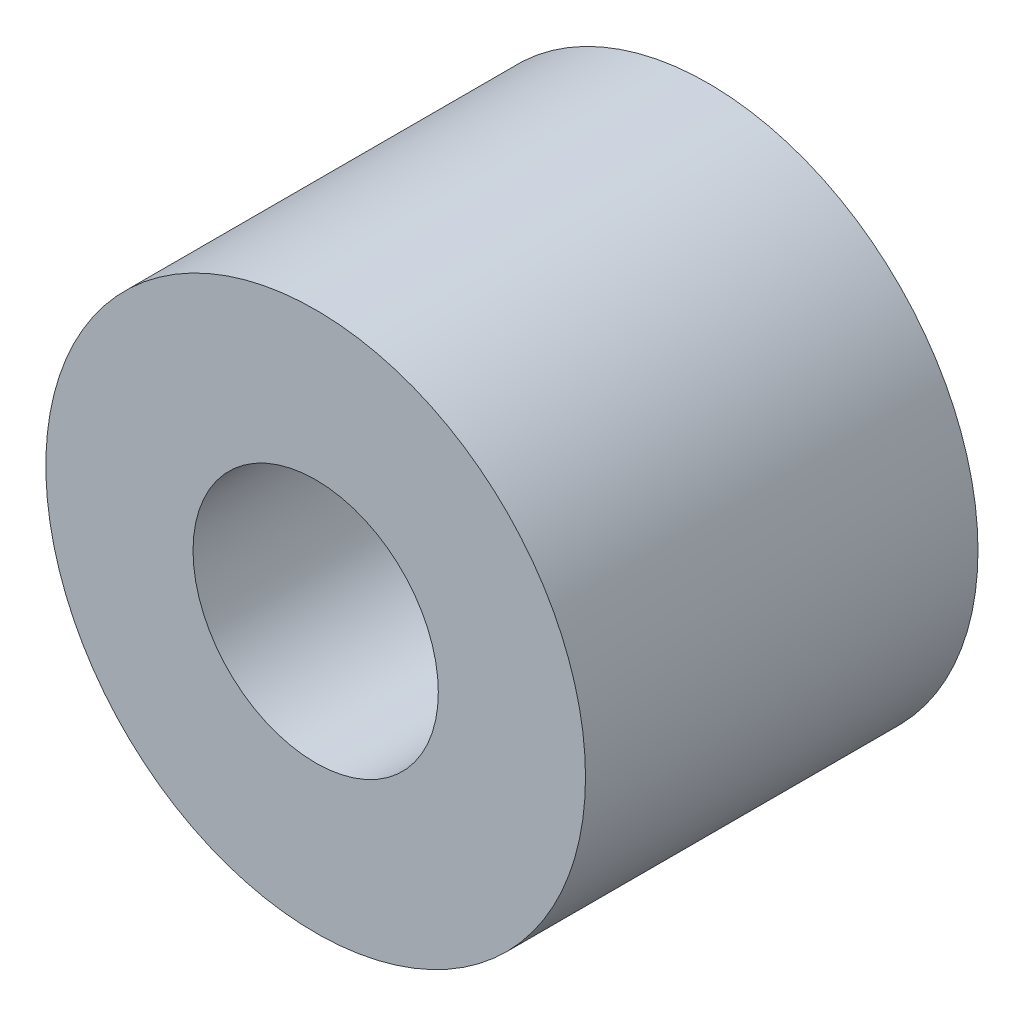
ISO-10303-21;
HEADER;
FILE_DESCRIPTION(('STEP AP214'),'2;1');
FILE_NAME('part.step','',(''),(''),'','','');
FILE_SCHEMA(('AUTOMOTIVE_DESIGN { 1 0 10303 214 1 1 1 1 }'));
ENDSEC;
DATA;
#1=APPLICATION_CONTEXT('core data for automotive mechanical design processes');
#2=APPLICATION_PROTOCOL_DEFINITION('international standard','automotive_design',2000,#1);
#3=PRODUCT_CONTEXT('',#1,'mechanical');
#4=PRODUCT('Part','Part','',(#3));
#5=PRODUCT_RELATED_PRODUCT_CATEGORY('part','',(#4));
#6=PRODUCT_DEFINITION_FORMATION('','',#4);
#7=PRODUCT_DEFINITION_CONTEXT('part definition',#1,'design');
#8=PRODUCT_DEFINITION('design','',#6,#7);
#9=PRODUCT_DEFINITION_SHAPE('','',#8);
#10=(LENGTH_UNIT() NAMED_UNIT(*) SI_UNIT(.MILLI.,.METRE.));
#11=(NAMED_UNIT(*) PLANE_ANGLE_UNIT() SI_UNIT($,.RADIAN.));
#12=(NAMED_UNIT(*) SI_UNIT($,.STERADIAN.) SOLID_ANGLE_UNIT());
#13=UNCERTAINTY_MEASURE_WITH_UNIT(LENGTH_MEASURE(1.E-05),#10,'distance_accuracy_value','');
#14=(GEOMETRIC_REPRESENTATION_CONTEXT(3) GLOBAL_UNCERTAINTY_ASSIGNED_CONTEXT((#13)) GLOBAL_UNIT_ASSIGNED_CONTEXT((#10,
#11,#12)) REPRESENTATION_CONTEXT('',''));
#15=CARTESIAN_POINT('',(0.,0.,0.));
#16=DIRECTION('',(0.,0.,1.));
#17=DIRECTION('',(1.,0.,0.));
#18=AXIS2_PLACEMENT_3D('',#15,#16,#17);
#19=CARTESIAN_POINT('',(0.,0.,80.));
#20=DIRECTION('',(0.,0.,1.));
#21=DIRECTION('',(1.,0.,0.));
#22=AXIS2_PLACEMENT_3D('',#19,#20,#21);
#23=PLANE('',#22);
#24=CARTESIAN_POINT('',(0.,0.,80.));
#25=DIRECTION('',(0.,0.,1.));
#26=DIRECTION('',(1.,0.,0.));
#27=AXIS2_PLACEMENT_3D('',#24,#25,#26);
#28=CIRCLE('',#27,55.);
#29=CARTESIAN_POINT('',(55.,0.,80.));
#30=VERTEX_POINT('',#29);
#31=EDGE_CURVE('E10',#30,#30,#28,.T.);
#32=ORIENTED_EDGE('',*,*,#31,.T.);
#33=EDGE_LOOP('',(#32));
#34=FACE_BOUND('',#33,.T.);
#35=CARTESIAN_POINT('',(0.,0.,80.));
#36=DIRECTION('',(0.,0.,1.));
#37=DIRECTION('',(1.,0.,0.));
#38=AXIS2_PLACEMENT_3D('',#35,#36,#37);
#39=CIRCLE('',#38,25.);
#40=CARTESIAN_POINT('',(25.,0.,80.));
#41=VERTEX_POINT('',#40);
#42=EDGE_CURVE('E40',#41,#41,#39,.T.);
#43=ORIENTED_EDGE('',*,*,#42,.F.);
#44=EDGE_LOOP('',(#43));
#45=FACE_BOUND('',#44,.T.);
#46=ADVANCED_FACE('F29',(#34,#45),#23,.T.);
#47=CARTESIAN_POINT('',(0.,0.,0.));
#48=DIRECTION('',(0.,0.,1.));
#49=DIRECTION('',(1.,0.,0.));
#50=AXIS2_PLACEMENT_3D('',#47,#48,#49);
#51=PLANE('',#50);
#52=CARTESIAN_POINT('',(0.,0.,0.));
#53=DIRECTION('',(0.,0.,1.));
#54=DIRECTION('',(1.,0.,0.));
#55=AXIS2_PLACEMENT_3D('',#52,#53,#54);
#56=CIRCLE('',#55,55.);
#57=CARTESIAN_POINT('',(55.,0.,0.));
#58=VERTEX_POINT('',#57);
#59=EDGE_CURVE('E33',#58,#58,#56,.T.);
#60=ORIENTED_EDGE('',*,*,#59,.F.);
#61=EDGE_LOOP('',(#60));
#62=FACE_BOUND('',#61,.T.);
#63=CARTESIAN_POINT('',(0.,0.,0.));
#64=DIRECTION('',(0.,0.,1.));
#65=DIRECTION('',(1.,0.,0.));
#66=AXIS2_PLACEMENT_3D('',#63,#64,#65);
#67=CIRCLE('',#66,25.);
#68=CARTESIAN_POINT('',(25.,0.,0.));
#69=VERTEX_POINT('',#68);
#70=EDGE_CURVE('E42',#69,#69,#67,.T.);
#71=ORIENTED_EDGE('',*,*,#70,.T.);
#72=EDGE_LOOP('',(#71));
#73=FACE_BOUND('',#72,.T.);
#74=ADVANCED_FACE('F52',(#62,#73),#51,.F.);
#75=CARTESIAN_POINT('',(0.,0.,80.));
#76=DIRECTION('',(0.,0.,-1.));
#77=DIRECTION('',(-1.,0.,0.));
#78=AXIS2_PLACEMENT_3D('',#75,#76,#77);
#79=CYLINDRICAL_SURFACE('',#78,55.);
#80=ORIENTED_EDGE('',*,*,#31,.F.);
#81=EDGE_LOOP('',(#80));
#82=FACE_BOUND('',#81,.T.);
#83=ORIENTED_EDGE('',*,*,#59,.T.);
#84=EDGE_LOOP('',(#83));
#85=FACE_BOUND('',#84,.T.);
#86=ADVANCED_FACE('F31',(#82,#85),#79,.T.);
#87=CARTESIAN_POINT('',(0.,0.,80.));
#88=DIRECTION('',(0.,0.,-1.));
#89=DIRECTION('',(-1.,0.,0.));
#90=AXIS2_PLACEMENT_3D('',#87,#88,#89);
#91=CYLINDRICAL_SURFACE('',#90,25.);
#92=ORIENTED_EDGE('',*,*,#42,.T.);
#93=EDGE_LOOP('',(#92));
#94=FACE_BOUND('',#93,.T.);
#95=ORIENTED_EDGE('',*,*,#70,.F.);
#96=EDGE_LOOP('',(#95));
#97=FACE_BOUND('',#96,.T.);
#98=ADVANCED_FACE('F48',(#94,#97),#91,.F.);
#99=CLOSED_SHELL('',(#46,#74,#86,#98));
#100=MANIFOLD_SOLID_BREP('B2',#99);
#101=ADVANCED_BREP_SHAPE_REPRESENTATION('',(#18,#100),#14);
#102=SHAPE_DEFINITION_REPRESENTATION(#9,#101);
ENDSEC;
END-ISO-10303-21;
